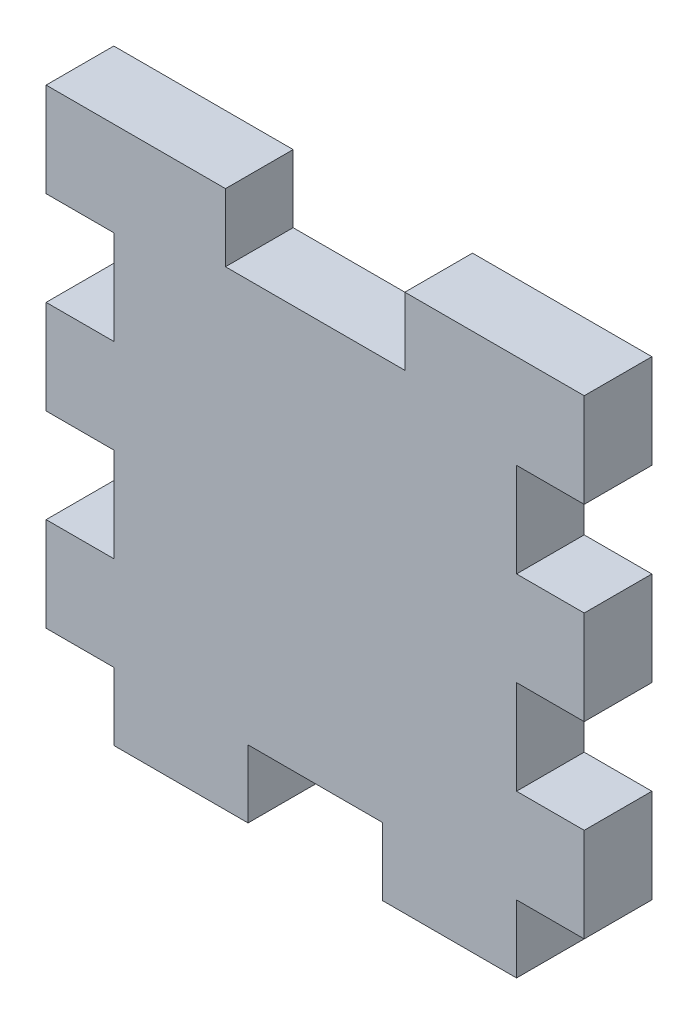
from build123d import *

# Parameters (mm, degrees)
SKETCH1_W           = 31.75
SKETCH1_H           = 31.75
BOSS_EXTRUDE1_DEPTH = 5.334
SKETCH4_W           = 31.75
SKETCH4_H           = 5.334
BOSS_EXTRUDE6_DEPTH = 5.334
SKETCH7_W           = 5.334
SKETCH7_H           = 7.4168
CUT_EXTRUDE2_DEPTH  = 31.464650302
SKETCH8_W           = 14.139333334
SKETCH8_H           = 5.334
CUT_EXTRUDE3_DEPTH  = 31.464650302
SKETCH9_W           = 10.583333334
SKETCH9_H           = 5.334
CUT_EXTRUDE5_DEPTH  = 31.464650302


with BuildPart() as part:
    # Sketch1 → Boss-Extrude1 (new body)
    with BuildSketch(Plane.XY):
        Rectangle(SKETCH1_W, SKETCH1_H)
    extrude(amount=BOSS_EXTRUDE1_DEPTH)

    # Sketch4 → Boss-Extrude6 (add, through all)
    with BuildSketch(Plane.XY.offset(5.334)):
        Polygon((-15.875, 15.875), (-15.875, 21.209), (-21.209, 21.209), (-21.209, -15.875), (-15.875, -15.875), align=None)
        Polygon((-15.875, 15.875), (-15.875, 21.209), (15.875, 21.209), (21.209, 21.209), (21.209, -15.875), (15.875, -15.875), (15.875, 15.875), align=None)
        with Locations((0, -18.542)):
            Rectangle(SKETCH4_W, SKETCH4_H)
    extrude(amount=-BOSS_EXTRUDE6_DEPTH)

    # Sketch7 → Cut-Extrude2 (cut, through all)
    with BuildSketch(Plane.XY.offset(5.334)):
        with Locations((-18.542, -4.7498)):
            Rectangle(SKETCH7_W, SKETCH7_H)
        with Locations((-18.542, 10.0838)):
            Rectangle(SKETCH7_W, SKETCH7_H)
        with Locations((18.542, 10.0838)):
            Rectangle(SKETCH7_W, SKETCH7_H)
        with Locations((18.542, -4.7498)):
            Rectangle(SKETCH7_W, SKETCH7_H)
    extrude(amount=-CUT_EXTRUDE2_DEPTH, mode=Mode.SUBTRACT)

    # Sketch8 → Cut-Extrude3 (cut, through all)
    with BuildSketch(Plane.XY.offset(5.334)):
        with Locations((0, 18.542)):
            Rectangle(SKETCH8_W, SKETCH8_H)
    extrude(amount=-CUT_EXTRUDE3_DEPTH, mode=Mode.SUBTRACT)

    # Sketch9 → Cut-Extrude5 (cut, through all)
    with BuildSketch(Plane.XY.offset(5.334)):
        with Locations((0, -18.542)):
            Rectangle(SKETCH9_W, SKETCH9_H)
    extrude(amount=-CUT_EXTRUDE5_DEPTH, mode=Mode.SUBTRACT)


solid = part.part
